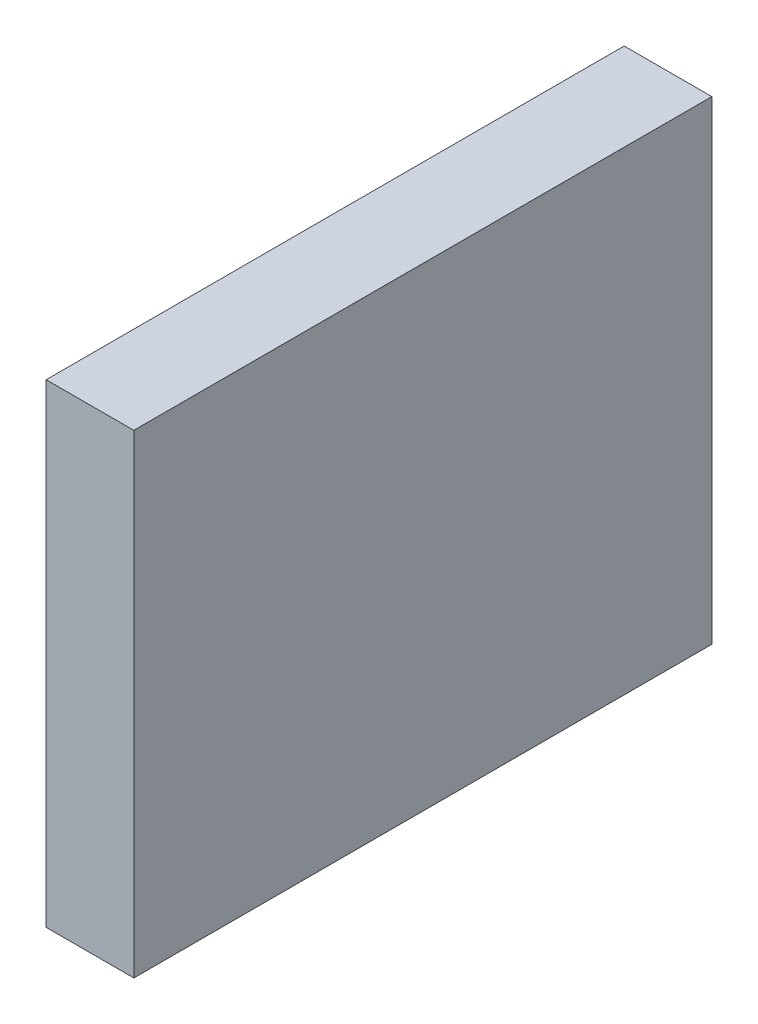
from build123d import *

# Parameters (mm, degrees)
SKIZZE1_W               = 15.46938328
SKIZZE1_H               = 83.700082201
LINEAR_AUSTRAGEN1_DEPTH = 102


with BuildPart() as part:
    # Skizze1 → Linear austragen1 (new body)
    with BuildSketch(Plane.XY):
        with Locations((7.73469164, 41.850041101)):
            Rectangle(SKIZZE1_W, SKIZZE1_H)
    extrude(amount=LINEAR_AUSTRAGEN1_DEPTH)


solid = part.part
